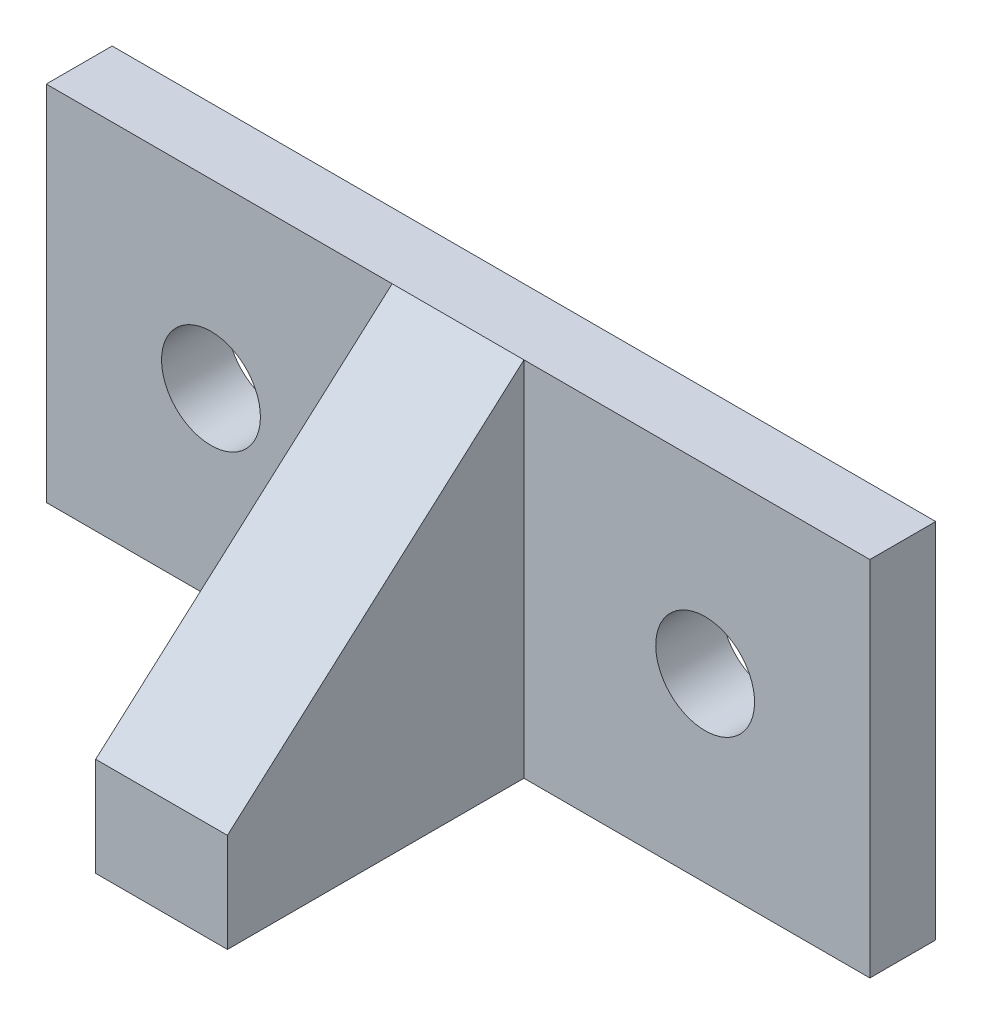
ISO-10303-21;
HEADER;
FILE_DESCRIPTION(('STEP AP214'),'2;1');
FILE_NAME('part.step','',(''),(''),'','','');
FILE_SCHEMA(('AUTOMOTIVE_DESIGN { 1 0 10303 214 1 1 1 1 }'));
ENDSEC;
DATA;
#1=APPLICATION_CONTEXT('core data for automotive mechanical design processes');
#2=APPLICATION_PROTOCOL_DEFINITION('international standard','automotive_design',2000,#1);
#3=PRODUCT_CONTEXT('',#1,'mechanical');
#4=PRODUCT('Part','Part','',(#3));
#5=PRODUCT_RELATED_PRODUCT_CATEGORY('part','',(#4));
#6=PRODUCT_DEFINITION_FORMATION('','',#4);
#7=PRODUCT_DEFINITION_CONTEXT('part definition',#1,'design');
#8=PRODUCT_DEFINITION('design','',#6,#7);
#9=PRODUCT_DEFINITION_SHAPE('','',#8);
#10=(LENGTH_UNIT() NAMED_UNIT(*) SI_UNIT(.MILLI.,.METRE.));
#11=(NAMED_UNIT(*) PLANE_ANGLE_UNIT() SI_UNIT($,.RADIAN.));
#12=(NAMED_UNIT(*) SI_UNIT($,.STERADIAN.) SOLID_ANGLE_UNIT());
#13=UNCERTAINTY_MEASURE_WITH_UNIT(LENGTH_MEASURE(1.E-05),#10,'distance_accuracy_value','');
#14=(GEOMETRIC_REPRESENTATION_CONTEXT(3) GLOBAL_UNCERTAINTY_ASSIGNED_CONTEXT((#13)) GLOBAL_UNIT_ASSIGNED_CONTEXT((#10,
#11,#12)) REPRESENTATION_CONTEXT('',''));
#15=CARTESIAN_POINT('',(0.,0.,0.));
#16=DIRECTION('',(0.,0.,1.));
#17=DIRECTION('',(1.,0.,0.));
#18=AXIS2_PLACEMENT_3D('',#15,#16,#17);
#19=CARTESIAN_POINT('',(0.,0.,55.));
#20=DIRECTION('',(0.,0.,-1.));
#21=DIRECTION('',(-1.,0.,0.));
#22=AXIS2_PLACEMENT_3D('',#19,#20,#21);
#23=PLANE('',#22);
#24=DIRECTION('',(0.,-1.,0.));
#25=VECTOR('',#24,1.);
#26=CARTESIAN_POINT('',(9.99999999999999,-27.5,55.));
#27=LINE('',#26,#25);
#28=CARTESIAN_POINT('',(9.99999999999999,-12.5,55.));
#29=VERTEX_POINT('',#28);
#30=CARTESIAN_POINT('',(9.99999999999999,-27.5,55.));
#31=VERTEX_POINT('',#30);
#32=EDGE_CURVE('E69',#29,#31,#27,.T.);
#33=ORIENTED_EDGE('',*,*,#32,.F.);
#34=DIRECTION('',(1.,0.,0.));
#35=VECTOR('',#34,1.);
#36=CARTESIAN_POINT('',(-62.5,-12.5,55.));
#37=LINE('',#36,#35);
#38=CARTESIAN_POINT('',(-10.,-12.5,55.));
#39=VERTEX_POINT('',#38);
#40=EDGE_CURVE('E112',#39,#29,#37,.T.);
#41=ORIENTED_EDGE('',*,*,#40,.F.);
#42=DIRECTION('',(0.,1.,0.));
#43=VECTOR('',#42,1.);
#44=CARTESIAN_POINT('',(-10.,-27.5,55.));
#45=LINE('',#44,#43);
#46=CARTESIAN_POINT('',(-10.,-27.5,55.));
#47=VERTEX_POINT('',#46);
#48=EDGE_CURVE('E232',#47,#39,#45,.T.);
#49=ORIENTED_EDGE('',*,*,#48,.F.);
#50=DIRECTION('',(1.,0.,0.));
#51=VECTOR('',#50,1.);
#52=CARTESIAN_POINT('',(-62.5,-27.5,55.));
#53=LINE('',#52,#51);
#54=EDGE_CURVE('E128',#47,#31,#53,.T.);
#55=ORIENTED_EDGE('',*,*,#54,.T.);
#56=EDGE_LOOP('',(#33,#41,#49,#55));
#57=FACE_BOUND('',#56,.T.);
#58=ADVANCED_FACE('F45',(#57),#23,.F.);
#59=CARTESIAN_POINT('',(0.,0.,0.));
#60=DIRECTION('',(0.,0.,-1.));
#61=DIRECTION('',(-1.,0.,0.));
#62=AXIS2_PLACEMENT_3D('',#59,#60,#61);
#63=PLANE('',#62);
#64=CARTESIAN_POINT('',(-37.5,0.,0.));
#65=DIRECTION('',(0.,0.,1.));
#66=DIRECTION('',(1.,0.,0.));
#67=AXIS2_PLACEMENT_3D('',#64,#65,#66);
#68=CIRCLE('',#67,7.5);
#69=CARTESIAN_POINT('',(-30.,0.,0.));
#70=VERTEX_POINT('',#69);
#71=EDGE_CURVE('E153',#70,#70,#68,.T.);
#72=ORIENTED_EDGE('',*,*,#71,.T.);
#73=EDGE_LOOP('',(#72));
#74=FACE_BOUND('',#73,.T.);
#75=DIRECTION('',(0.,1.,0.));
#76=VECTOR('',#75,1.);
#77=CARTESIAN_POINT('',(62.5,-27.5,0.));
#78=LINE('',#77,#76);
#79=CARTESIAN_POINT('',(62.5,-27.5,0.));
#80=VERTEX_POINT('',#79);
#81=CARTESIAN_POINT('',(62.5,27.5,0.));
#82=VERTEX_POINT('',#81);
#83=EDGE_CURVE('E157',#80,#82,#78,.T.);
#84=ORIENTED_EDGE('',*,*,#83,.F.);
#85=DIRECTION('',(1.,0.,0.));
#86=VECTOR('',#85,1.);
#87=CARTESIAN_POINT('',(-62.5,-27.5,0.));
#88=LINE('',#87,#86);
#89=CARTESIAN_POINT('',(-62.5,-27.5,0.));
#90=VERTEX_POINT('',#89);
#91=EDGE_CURVE('E161',#90,#80,#88,.T.);
#92=ORIENTED_EDGE('',*,*,#91,.F.);
#93=DIRECTION('',(0.,-1.,0.));
#94=VECTOR('',#93,1.);
#95=CARTESIAN_POINT('',(-62.5,-27.5,0.));
#96=LINE('',#95,#94);
#97=CARTESIAN_POINT('',(-62.5,27.5,0.));
#98=VERTEX_POINT('',#97);
#99=EDGE_CURVE('E169',#98,#90,#96,.T.);
#100=ORIENTED_EDGE('',*,*,#99,.F.);
#101=DIRECTION('',(-1.,0.,0.));
#102=VECTOR('',#101,1.);
#103=CARTESIAN_POINT('',(-62.5,27.5,0.));
#104=LINE('',#103,#102);
#105=EDGE_CURVE('E165',#82,#98,#104,.T.);
#106=ORIENTED_EDGE('',*,*,#105,.F.);
#107=EDGE_LOOP('',(#84,#92,#100,#106));
#108=FACE_BOUND('',#107,.T.);
#109=CARTESIAN_POINT('',(37.5,0.,0.));
#110=DIRECTION('',(0.,0.,1.));
#111=DIRECTION('',(1.,0.,0.));
#112=AXIS2_PLACEMENT_3D('',#109,#110,#111);
#113=CIRCLE('',#112,7.5);
#114=CARTESIAN_POINT('',(45.,0.,0.));
#115=VERTEX_POINT('',#114);
#116=EDGE_CURVE('E149',#115,#115,#113,.T.);
#117=ORIENTED_EDGE('',*,*,#116,.T.);
#118=EDGE_LOOP('',(#117));
#119=FACE_BOUND('',#118,.T.);
#120=ADVANCED_FACE('F223',(#74,#108,#119),#63,.T.);
#121=CARTESIAN_POINT('',(62.5,-27.5,55.));
#122=DIRECTION('',(-1.,0.,0.));
#123=DIRECTION('',(0.,0.,1.));
#124=AXIS2_PLACEMENT_3D('',#121,#122,#123);
#125=PLANE('',#124);
#126=DIRECTION('',(0.,0.,-1.));
#127=VECTOR('',#126,1.);
#128=CARTESIAN_POINT('',(62.5,27.5,55.));
#129=LINE('',#128,#127);
#130=CARTESIAN_POINT('',(62.5,27.5,10.));
#131=VERTEX_POINT('',#130);
#132=EDGE_CURVE('E54',#131,#82,#129,.T.);
#133=ORIENTED_EDGE('',*,*,#132,.F.);
#134=DIRECTION('',(0.,1.,0.));
#135=VECTOR('',#134,1.);
#136=CARTESIAN_POINT('',(62.5,27.5,10.));
#137=LINE('',#136,#135);
#138=CARTESIAN_POINT('',(62.5,-27.5,10.));
#139=VERTEX_POINT('',#138);
#140=EDGE_CURVE('E141',#139,#131,#137,.T.);
#141=ORIENTED_EDGE('',*,*,#140,.F.);
#142=DIRECTION('',(0.,0.,-1.));
#143=VECTOR('',#142,1.);
#144=CARTESIAN_POINT('',(62.5,-27.5,55.));
#145=LINE('',#144,#143);
#146=EDGE_CURVE('E160',#139,#80,#145,.T.);
#147=ORIENTED_EDGE('',*,*,#146,.T.);
#148=ORIENTED_EDGE('',*,*,#83,.T.);
#149=EDGE_LOOP('',(#133,#141,#147,#148));
#150=FACE_BOUND('',#149,.T.);
#151=ADVANCED_FACE('F47',(#150),#125,.F.);
#152=CARTESIAN_POINT('',(-62.5,27.5,55.));
#153=DIRECTION('',(0.,-1.,0.));
#154=DIRECTION('',(0.,0.,-1.));
#155=AXIS2_PLACEMENT_3D('',#152,#153,#154);
#156=PLANE('',#155);
#157=DIRECTION('',(-1.,0.,0.));
#158=VECTOR('',#157,1.);
#159=CARTESIAN_POINT('',(-10.,27.5,9.99999999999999));
#160=LINE('',#159,#158);
#161=CARTESIAN_POINT('',(-10.,27.5,9.99999999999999));
#162=VERTEX_POINT('',#161);
#163=CARTESIAN_POINT('',(-62.5,27.5,9.99999999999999));
#164=VERTEX_POINT('',#163);
#165=EDGE_CURVE('E195',#162,#164,#160,.T.);
#166=ORIENTED_EDGE('',*,*,#165,.F.);
#167=DIRECTION('',(1.,0.,0.));
#168=VECTOR('',#167,1.);
#169=CARTESIAN_POINT('',(-62.5,27.5,10.));
#170=LINE('',#169,#168);
#171=CARTESIAN_POINT('',(9.99999999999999,27.5,10.));
#172=VERTEX_POINT('',#171);
#173=EDGE_CURVE('E120',#162,#172,#170,.T.);
#174=ORIENTED_EDGE('',*,*,#173,.T.);
#175=DIRECTION('',(1.,0.,0.));
#176=VECTOR('',#175,1.);
#177=CARTESIAN_POINT('',(9.99999999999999,27.5,10.));
#178=LINE('',#177,#176);
#179=EDGE_CURVE('E135',#172,#131,#178,.T.);
#180=ORIENTED_EDGE('',*,*,#179,.T.);
#181=ORIENTED_EDGE('',*,*,#132,.T.);
#182=ORIENTED_EDGE('',*,*,#105,.T.);
#183=DIRECTION('',(0.,0.,-1.));
#184=VECTOR('',#183,1.);
#185=CARTESIAN_POINT('',(-62.5,27.5,55.));
#186=LINE('',#185,#184);
#187=EDGE_CURVE('E181',#164,#98,#186,.T.);
#188=ORIENTED_EDGE('',*,*,#187,.F.);
#189=EDGE_LOOP('',(#166,#174,#180,#181,#182,#188));
#190=FACE_BOUND('',#189,.T.);
#191=ADVANCED_FACE('F219',(#190),#156,.F.);
#192=CARTESIAN_POINT('',(-62.5,-27.5,55.));
#193=DIRECTION('',(1.,0.,0.));
#194=DIRECTION('',(0.,0.,-1.));
#195=AXIS2_PLACEMENT_3D('',#192,#193,#194);
#196=PLANE('',#195);
#197=DIRECTION('',(0.,0.,-1.));
#198=VECTOR('',#197,1.);
#199=CARTESIAN_POINT('',(-62.5,-27.5,55.));
#200=LINE('',#199,#198);
#201=CARTESIAN_POINT('',(-62.5,-27.5,10.));
#202=VERTEX_POINT('',#201);
#203=EDGE_CURVE('E178',#202,#90,#200,.T.);
#204=ORIENTED_EDGE('',*,*,#203,.F.);
#205=DIRECTION('',(0.,-1.,0.));
#206=VECTOR('',#205,1.);
#207=CARTESIAN_POINT('',(-62.5,27.5,9.99999999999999));
#208=LINE('',#207,#206);
#209=EDGE_CURVE('E203',#164,#202,#208,.T.);
#210=ORIENTED_EDGE('',*,*,#209,.F.);
#211=ORIENTED_EDGE('',*,*,#187,.T.);
#212=ORIENTED_EDGE('',*,*,#99,.T.);
#213=EDGE_LOOP('',(#204,#210,#211,#212));
#214=FACE_BOUND('',#213,.T.);
#215=ADVANCED_FACE('F227',(#214),#196,.F.);
#216=CARTESIAN_POINT('',(-62.5,-27.5,55.));
#217=DIRECTION('',(0.,1.,0.));
#218=DIRECTION('',(0.,0.,1.));
#219=AXIS2_PLACEMENT_3D('',#216,#217,#218);
#220=PLANE('',#219);
#221=DIRECTION('',(0.,0.,1.));
#222=VECTOR('',#221,1.);
#223=CARTESIAN_POINT('',(-10.,-27.5,10.));
#224=LINE('',#223,#222);
#225=CARTESIAN_POINT('',(-10.,-27.5,9.99999999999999));
#226=VERTEX_POINT('',#225);
#227=EDGE_CURVE('E234',#226,#47,#224,.T.);
#228=ORIENTED_EDGE('',*,*,#227,.F.);
#229=DIRECTION('',(-1.,0.,0.));
#230=VECTOR('',#229,1.);
#231=CARTESIAN_POINT('',(-10.,-27.5,10.));
#232=LINE('',#231,#230);
#233=EDGE_CURVE('E190',#226,#202,#232,.T.);
#234=ORIENTED_EDGE('',*,*,#233,.T.);
#235=ORIENTED_EDGE('',*,*,#203,.T.);
#236=ORIENTED_EDGE('',*,*,#91,.T.);
#237=ORIENTED_EDGE('',*,*,#146,.F.);
#238=DIRECTION('',(1.,0.,0.));
#239=VECTOR('',#238,1.);
#240=CARTESIAN_POINT('',(9.99999999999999,-27.5,10.));
#241=LINE('',#240,#239);
#242=CARTESIAN_POINT('',(9.99999999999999,-27.5,10.));
#243=VERTEX_POINT('',#242);
#244=EDGE_CURVE('E131',#243,#139,#241,.T.);
#245=ORIENTED_EDGE('',*,*,#244,.F.);
#246=DIRECTION('',(0.,0.,-1.));
#247=VECTOR('',#246,1.);
#248=CARTESIAN_POINT('',(9.99999999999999,-27.5,10.));
#249=LINE('',#248,#247);
#250=EDGE_CURVE('E137',#31,#243,#249,.T.);
#251=ORIENTED_EDGE('',*,*,#250,.F.);
#252=ORIENTED_EDGE('',*,*,#54,.F.);
#253=EDGE_LOOP('',(#228,#234,#235,#236,#237,#245,#251,#252));
#254=FACE_BOUND('',#253,.T.);
#255=ADVANCED_FACE('F208',(#254),#220,.F.);
#256=CARTESIAN_POINT('',(-37.5,0.,55.));
#257=DIRECTION('',(0.,0.,-1.));
#258=DIRECTION('',(-1.,0.,0.));
#259=AXIS2_PLACEMENT_3D('',#256,#257,#258);
#260=CYLINDRICAL_SURFACE('',#259,7.5);
#261=CARTESIAN_POINT('',(-37.5,0.,9.99999999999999));
#262=DIRECTION('',(0.,0.,-1.));
#263=DIRECTION('',(0.,1.,0.));
#264=AXIS2_PLACEMENT_3D('',#261,#262,#263);
#265=CIRCLE('',#264,7.5);
#266=CARTESIAN_POINT('',(-37.5,7.5,9.99999999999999));
#267=VERTEX_POINT('',#266);
#268=EDGE_CURVE('E144',#267,#267,#265,.T.);
#269=ORIENTED_EDGE('',*,*,#268,.F.);
#270=EDGE_LOOP('',(#269));
#271=FACE_BOUND('',#270,.T.);
#272=ORIENTED_EDGE('',*,*,#71,.F.);
#273=EDGE_LOOP('',(#272));
#274=FACE_BOUND('',#273,.T.);
#275=ADVANCED_FACE('F260',(#271,#274),#260,.F.);
#276=CARTESIAN_POINT('',(37.5,0.,55.));
#277=DIRECTION('',(0.,0.,-1.));
#278=DIRECTION('',(-1.,0.,0.));
#279=AXIS2_PLACEMENT_3D('',#276,#277,#278);
#280=CYLINDRICAL_SURFACE('',#279,7.5);
#281=CARTESIAN_POINT('',(37.5,0.,10.));
#282=DIRECTION('',(0.,0.,-1.));
#283=DIRECTION('',(0.,1.,0.));
#284=AXIS2_PLACEMENT_3D('',#281,#282,#283);
#285=CIRCLE('',#284,7.5);
#286=CARTESIAN_POINT('',(37.5,7.5,10.));
#287=VERTEX_POINT('',#286);
#288=EDGE_CURVE('E147',#287,#287,#285,.T.);
#289=ORIENTED_EDGE('',*,*,#288,.F.);
#290=EDGE_LOOP('',(#289));
#291=FACE_BOUND('',#290,.T.);
#292=ORIENTED_EDGE('',*,*,#116,.F.);
#293=EDGE_LOOP('',(#292));
#294=FACE_BOUND('',#293,.T.);
#295=ADVANCED_FACE('F278',(#291,#294),#280,.F.);
#296=CARTESIAN_POINT('',(9.99999999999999,27.5,10.));
#297=DIRECTION('',(0.,0.,-1.));
#298=DIRECTION('',(0.,1.,0.));
#299=AXIS2_PLACEMENT_3D('',#296,#297,#298);
#300=PLANE('',#299);
#301=ORIENTED_EDGE('',*,*,#288,.T.);
#302=EDGE_LOOP('',(#301));
#303=FACE_BOUND('',#302,.T.);
#304=ORIENTED_EDGE('',*,*,#140,.T.);
#305=ORIENTED_EDGE('',*,*,#179,.F.);
#306=DIRECTION('',(0.,1.,0.));
#307=VECTOR('',#306,1.);
#308=CARTESIAN_POINT('',(9.99999999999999,27.5,10.));
#309=LINE('',#308,#307);
#310=EDGE_CURVE('E124',#243,#172,#309,.T.);
#311=ORIENTED_EDGE('',*,*,#310,.F.);
#312=ORIENTED_EDGE('',*,*,#244,.T.);
#313=EDGE_LOOP('',(#304,#305,#311,#312));
#314=FACE_BOUND('',#313,.T.);
#315=ADVANCED_FACE('F211',(#303,#314),#300,.F.);
#316=CARTESIAN_POINT('',(9.99999999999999,0.,0.));
#317=DIRECTION('',(-1.,0.,0.));
#318=DIRECTION('',(0.,0.,1.));
#319=AXIS2_PLACEMENT_3D('',#316,#317,#318);
#320=PLANE('',#319);
#321=ORIENTED_EDGE('',*,*,#310,.T.);
#322=DIRECTION('',(0.,0.66436383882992,-0.74740931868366));
#323=VECTOR('',#322,1.);
#324=CARTESIAN_POINT('',(9.99999999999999,-12.5,55.));
#325=LINE('',#324,#323);
#326=EDGE_CURVE('E114',#29,#172,#325,.T.);
#327=ORIENTED_EDGE('',*,*,#326,.F.);
#328=ORIENTED_EDGE('',*,*,#32,.T.);
#329=ORIENTED_EDGE('',*,*,#250,.T.);
#330=EDGE_LOOP('',(#321,#327,#328,#329));
#331=FACE_BOUND('',#330,.T.);
#332=ADVANCED_FACE('F123',(#331),#320,.F.);
#333=CARTESIAN_POINT('',(-10.,27.5,9.99999999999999));
#334=DIRECTION('',(0.,0.,-1.));
#335=DIRECTION('',(0.,1.,0.));
#336=AXIS2_PLACEMENT_3D('',#333,#334,#335);
#337=PLANE('',#336);
#338=ORIENTED_EDGE('',*,*,#268,.T.);
#339=EDGE_LOOP('',(#338));
#340=FACE_BOUND('',#339,.T.);
#341=ORIENTED_EDGE('',*,*,#209,.T.);
#342=ORIENTED_EDGE('',*,*,#233,.F.);
#343=DIRECTION('',(0.,-1.,0.));
#344=VECTOR('',#343,1.);
#345=CARTESIAN_POINT('',(-10.,27.5,9.99999999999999));
#346=LINE('',#345,#344);
#347=EDGE_CURVE('E61',#162,#226,#346,.T.);
#348=ORIENTED_EDGE('',*,*,#347,.F.);
#349=ORIENTED_EDGE('',*,*,#165,.T.);
#350=EDGE_LOOP('',(#341,#342,#348,#349));
#351=FACE_BOUND('',#350,.T.);
#352=ADVANCED_FACE('F230',(#340,#351),#337,.F.);
#353=CARTESIAN_POINT('',(-10.,0.,0.));
#354=DIRECTION('',(-1.,0.,0.));
#355=DIRECTION('',(0.,0.,1.));
#356=AXIS2_PLACEMENT_3D('',#353,#354,#355);
#357=PLANE('',#356);
#358=DIRECTION('',(0.,-0.66436383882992,0.74740931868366));
#359=VECTOR('',#358,1.);
#360=CARTESIAN_POINT('',(-10.,20.3275862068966,18.0689655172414));
#361=LINE('',#360,#359);
#362=EDGE_CURVE('E11',#162,#39,#361,.T.);
#363=ORIENTED_EDGE('',*,*,#362,.F.);
#364=ORIENTED_EDGE('',*,*,#347,.T.);
#365=ORIENTED_EDGE('',*,*,#227,.T.);
#366=ORIENTED_EDGE('',*,*,#48,.T.);
#367=EDGE_LOOP('',(#363,#364,#365,#366));
#368=FACE_BOUND('',#367,.T.);
#369=ADVANCED_FACE('F241',(#368),#357,.T.);
#370=CARTESIAN_POINT('',(-62.5,-12.5,55.));
#371=DIRECTION('',(0.,-0.74740931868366,-0.66436383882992));
#372=DIRECTION('',(0.,0.66436383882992,-0.74740931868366));
#373=AXIS2_PLACEMENT_3D('',#370,#371,#372);
#374=PLANE('',#373);
#375=ORIENTED_EDGE('',*,*,#362,.T.);
#376=ORIENTED_EDGE('',*,*,#40,.T.);
#377=ORIENTED_EDGE('',*,*,#326,.T.);
#378=ORIENTED_EDGE('',*,*,#173,.F.);
#379=EDGE_LOOP('',(#375,#376,#377,#378));
#380=FACE_BOUND('',#379,.T.);
#381=ADVANCED_FACE('F113',(#380),#374,.F.);
#382=CLOSED_SHELL('',(#58,#120,#151,#191,#215,#255,#275,#295,#315,#332,#352,#369,#381));
#383=MANIFOLD_SOLID_BREP('B2',#382);
#384=ADVANCED_BREP_SHAPE_REPRESENTATION('',(#18,#383),#14);
#385=SHAPE_DEFINITION_REPRESENTATION(#9,#384);
ENDSEC;
END-ISO-10303-21;
